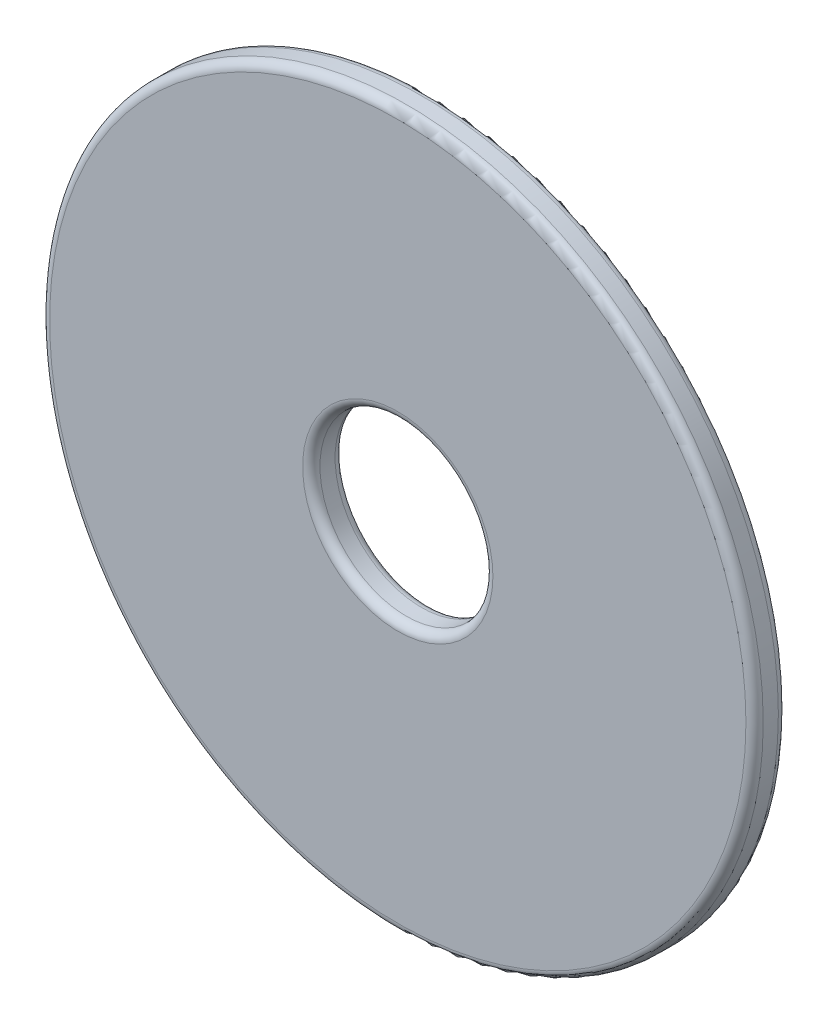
ISO-10303-21;
HEADER;
FILE_DESCRIPTION(('STEP AP214'),'2;1');
FILE_NAME('part.step','',(''),(''),'','','');
FILE_SCHEMA(('AUTOMOTIVE_DESIGN { 1 0 10303 214 1 1 1 1 }'));
ENDSEC;
DATA;
#1=APPLICATION_CONTEXT('core data for automotive mechanical design processes');
#2=APPLICATION_PROTOCOL_DEFINITION('international standard','automotive_design',2000,#1);
#3=PRODUCT_CONTEXT('',#1,'mechanical');
#4=PRODUCT('Part','Part','',(#3));
#5=PRODUCT_RELATED_PRODUCT_CATEGORY('part','',(#4));
#6=PRODUCT_DEFINITION_FORMATION('','',#4);
#7=PRODUCT_DEFINITION_CONTEXT('part definition',#1,'design');
#8=PRODUCT_DEFINITION('design','',#6,#7);
#9=PRODUCT_DEFINITION_SHAPE('','',#8);
#10=(LENGTH_UNIT() NAMED_UNIT(*) SI_UNIT(.MILLI.,.METRE.));
#11=(NAMED_UNIT(*) PLANE_ANGLE_UNIT() SI_UNIT($,.RADIAN.));
#12=(NAMED_UNIT(*) SI_UNIT($,.STERADIAN.) SOLID_ANGLE_UNIT());
#13=UNCERTAINTY_MEASURE_WITH_UNIT(LENGTH_MEASURE(1.E-05),#10,'distance_accuracy_value','');
#14=(GEOMETRIC_REPRESENTATION_CONTEXT(3) GLOBAL_UNCERTAINTY_ASSIGNED_CONTEXT((#13)) GLOBAL_UNIT_ASSIGNED_CONTEXT((#10,
#11,#12)) REPRESENTATION_CONTEXT('',''));
#15=CARTESIAN_POINT('',(0.,0.,0.));
#16=DIRECTION('',(0.,0.,1.));
#17=DIRECTION('',(1.,0.,0.));
#18=AXIS2_PLACEMENT_3D('',#15,#16,#17);
#19=CARTESIAN_POINT('',(0.,0.,0.75));
#20=DIRECTION('',(0.,0.,1.));
#21=DIRECTION('',(1.,0.,0.));
#22=AXIS2_PLACEMENT_3D('',#19,#20,#21);
#23=PLANE('',#22);
#24=CARTESIAN_POINT('',(0.,0.,0.75));
#25=DIRECTION('',(0.,0.,1.));
#26=DIRECTION('',(1.,0.,0.));
#27=AXIS2_PLACEMENT_3D('',#24,#25,#26);
#28=CIRCLE('',#27,2.2);
#29=CARTESIAN_POINT('',(2.2,0.,0.75));
#30=VERTEX_POINT('',#29);
#31=EDGE_CURVE('E10',#30,#30,#28,.F.);
#32=ORIENTED_EDGE('',*,*,#31,.T.);
#33=EDGE_LOOP('',(#32));
#34=FACE_BOUND('',#33,.T.);
#35=CARTESIAN_POINT('',(0.,0.,0.75));
#36=DIRECTION('',(0.,0.,1.));
#37=DIRECTION('',(1.,0.,0.));
#38=AXIS2_PLACEMENT_3D('',#35,#36,#37);
#39=CIRCLE('',#38,8.05);
#40=CARTESIAN_POINT('',(8.05,0.,0.75));
#41=VERTEX_POINT('',#40);
#42=EDGE_CURVE('E36',#41,#41,#39,.T.);
#43=ORIENTED_EDGE('',*,*,#42,.T.);
#44=EDGE_LOOP('',(#43));
#45=FACE_BOUND('',#44,.T.);
#46=ADVANCED_FACE('F29',(#34,#45),#23,.T.);
#47=CARTESIAN_POINT('',(0.,0.,0.));
#48=DIRECTION('',(0.,0.,1.));
#49=DIRECTION('',(1.,0.,0.));
#50=AXIS2_PLACEMENT_3D('',#47,#48,#49);
#51=PLANE('',#50);
#52=CARTESIAN_POINT('',(0.,0.,0.));
#53=DIRECTION('',(0.,0.,1.));
#54=DIRECTION('',(1.,0.,0.));
#55=AXIS2_PLACEMENT_3D('',#52,#53,#54);
#56=CIRCLE('',#55,2.2);
#57=CARTESIAN_POINT('',(2.2,0.,0.));
#58=VERTEX_POINT('',#57);
#59=EDGE_CURVE('E55',#58,#58,#56,.T.);
#60=ORIENTED_EDGE('',*,*,#59,.T.);
#61=EDGE_LOOP('',(#60));
#62=FACE_BOUND('',#61,.T.);
#63=CARTESIAN_POINT('',(0.,0.,0.));
#64=DIRECTION('',(0.,0.,1.));
#65=DIRECTION('',(1.,0.,0.));
#66=AXIS2_PLACEMENT_3D('',#63,#64,#65);
#67=CIRCLE('',#66,8.05);
#68=CARTESIAN_POINT('',(8.05,0.,0.));
#69=VERTEX_POINT('',#68);
#70=EDGE_CURVE('E58',#69,#69,#67,.F.);
#71=ORIENTED_EDGE('',*,*,#70,.T.);
#72=EDGE_LOOP('',(#71));
#73=FACE_BOUND('',#72,.T.);
#74=ADVANCED_FACE('F62',(#62,#73),#51,.F.);
#75=CARTESIAN_POINT('',(0.,0.,0.75));
#76=DIRECTION('',(0.,0.,-1.));
#77=DIRECTION('',(-1.,0.,0.));
#78=AXIS2_PLACEMENT_3D('',#75,#76,#77);
#79=CYLINDRICAL_SURFACE('',#78,8.25);
#80=CARTESIAN_POINT('',(0.,0.,0.2));
#81=DIRECTION('',(0.,0.,1.));
#82=DIRECTION('',(1.,0.,0.));
#83=AXIS2_PLACEMENT_3D('',#80,#81,#82);
#84=CIRCLE('',#83,8.25);
#85=CARTESIAN_POINT('',(8.25,0.,0.2));
#86=VERTEX_POINT('',#85);
#87=EDGE_CURVE('E40',#86,#86,#84,.T.);
#88=ORIENTED_EDGE('',*,*,#87,.T.);
#89=EDGE_LOOP('',(#88));
#90=FACE_BOUND('',#89,.T.);
#91=CARTESIAN_POINT('',(0.,0.,0.55));
#92=DIRECTION('',(0.,0.,1.));
#93=DIRECTION('',(1.,0.,0.));
#94=AXIS2_PLACEMENT_3D('',#91,#92,#93);
#95=CIRCLE('',#94,8.25);
#96=CARTESIAN_POINT('',(8.25,0.,0.55));
#97=VERTEX_POINT('',#96);
#98=EDGE_CURVE('E44',#97,#97,#95,.F.);
#99=ORIENTED_EDGE('',*,*,#98,.T.);
#100=EDGE_LOOP('',(#99));
#101=FACE_BOUND('',#100,.T.);
#102=ADVANCED_FACE('F31',(#90,#101),#79,.T.);
#103=CARTESIAN_POINT('',(0.,0.,0.75));
#104=DIRECTION('',(0.,0.,-1.));
#105=DIRECTION('',(-1.,0.,0.));
#106=AXIS2_PLACEMENT_3D('',#103,#104,#105);
#107=CYLINDRICAL_SURFACE('',#106,2.);
#108=CARTESIAN_POINT('',(0.,0.,0.2));
#109=DIRECTION('',(0.,0.,1.));
#110=DIRECTION('',(1.,0.,0.));
#111=AXIS2_PLACEMENT_3D('',#108,#109,#110);
#112=CIRCLE('',#111,2.);
#113=CARTESIAN_POINT('',(2.,0.,0.2));
#114=VERTEX_POINT('',#113);
#115=EDGE_CURVE('E49',#114,#114,#112,.F.);
#116=ORIENTED_EDGE('',*,*,#115,.T.);
#117=EDGE_LOOP('',(#116));
#118=FACE_BOUND('',#117,.T.);
#119=CARTESIAN_POINT('',(0.,0.,0.55));
#120=DIRECTION('',(0.,0.,1.));
#121=DIRECTION('',(1.,0.,0.));
#122=AXIS2_PLACEMENT_3D('',#119,#120,#121);
#123=CIRCLE('',#122,2.);
#124=CARTESIAN_POINT('',(2.,0.,0.55));
#125=VERTEX_POINT('',#124);
#126=EDGE_CURVE('E52',#125,#125,#123,.T.);
#127=ORIENTED_EDGE('',*,*,#126,.T.);
#128=EDGE_LOOP('',(#127));
#129=FACE_BOUND('',#128,.T.);
#130=ADVANCED_FACE('F74',(#118,#129),#107,.F.);
#131=CARTESIAN_POINT('',(0.,0.,0.2));
#132=DIRECTION('',(0.,0.,1.));
#133=DIRECTION('',(1.,0.,0.));
#134=AXIS2_PLACEMENT_3D('',#131,#132,#133);
#135=TOROIDAL_SURFACE('',#134,2.2,0.2);
#136=ORIENTED_EDGE('',*,*,#115,.F.);
#137=EDGE_LOOP('',(#136));
#138=FACE_BOUND('',#137,.T.);
#139=ORIENTED_EDGE('',*,*,#59,.F.);
#140=EDGE_LOOP('',(#139));
#141=FACE_BOUND('',#140,.T.);
#142=ADVANCED_FACE('F68',(#138,#141),#135,.T.);
#143=CARTESIAN_POINT('',(0.,0.,0.2));
#144=DIRECTION('',(0.,0.,1.));
#145=DIRECTION('',(1.,0.,0.));
#146=AXIS2_PLACEMENT_3D('',#143,#144,#145);
#147=TOROIDAL_SURFACE('',#146,8.05,0.2);
#148=ORIENTED_EDGE('',*,*,#70,.F.);
#149=EDGE_LOOP('',(#148));
#150=FACE_BOUND('',#149,.T.);
#151=ORIENTED_EDGE('',*,*,#87,.F.);
#152=EDGE_LOOP('',(#151));
#153=FACE_BOUND('',#152,.T.);
#154=ADVANCED_FACE('F64',(#150,#153),#147,.T.);
#155=CARTESIAN_POINT('',(0.,0.,0.55));
#156=DIRECTION('',(0.,0.,1.));
#157=DIRECTION('',(1.,0.,0.));
#158=AXIS2_PLACEMENT_3D('',#155,#156,#157);
#159=TOROIDAL_SURFACE('',#158,2.2,0.2);
#160=ORIENTED_EDGE('',*,*,#31,.F.);
#161=EDGE_LOOP('',(#160));
#162=FACE_BOUND('',#161,.T.);
#163=ORIENTED_EDGE('',*,*,#126,.F.);
#164=EDGE_LOOP('',(#163));
#165=FACE_BOUND('',#164,.T.);
#166=ADVANCED_FACE('F67',(#162,#165),#159,.T.);
#167=CARTESIAN_POINT('',(0.,0.,0.55));
#168=DIRECTION('',(0.,0.,1.));
#169=DIRECTION('',(1.,0.,0.));
#170=AXIS2_PLACEMENT_3D('',#167,#168,#169);
#171=TOROIDAL_SURFACE('',#170,8.05,0.2);
#172=ORIENTED_EDGE('',*,*,#98,.F.);
#173=EDGE_LOOP('',(#172));
#174=FACE_BOUND('',#173,.T.);
#175=ORIENTED_EDGE('',*,*,#42,.F.);
#176=EDGE_LOOP('',(#175));
#177=FACE_BOUND('',#176,.T.);
#178=ADVANCED_FACE('F77',(#174,#177),#171,.T.);
#179=CLOSED_SHELL('',(#46,#74,#102,#130,#142,#154,#166,#178));
#180=MANIFOLD_SOLID_BREP('B2',#179);
#181=ADVANCED_BREP_SHAPE_REPRESENTATION('',(#18,#180),#14);
#182=SHAPE_DEFINITION_REPRESENTATION(#9,#181);
ENDSEC;
END-ISO-10303-21;
